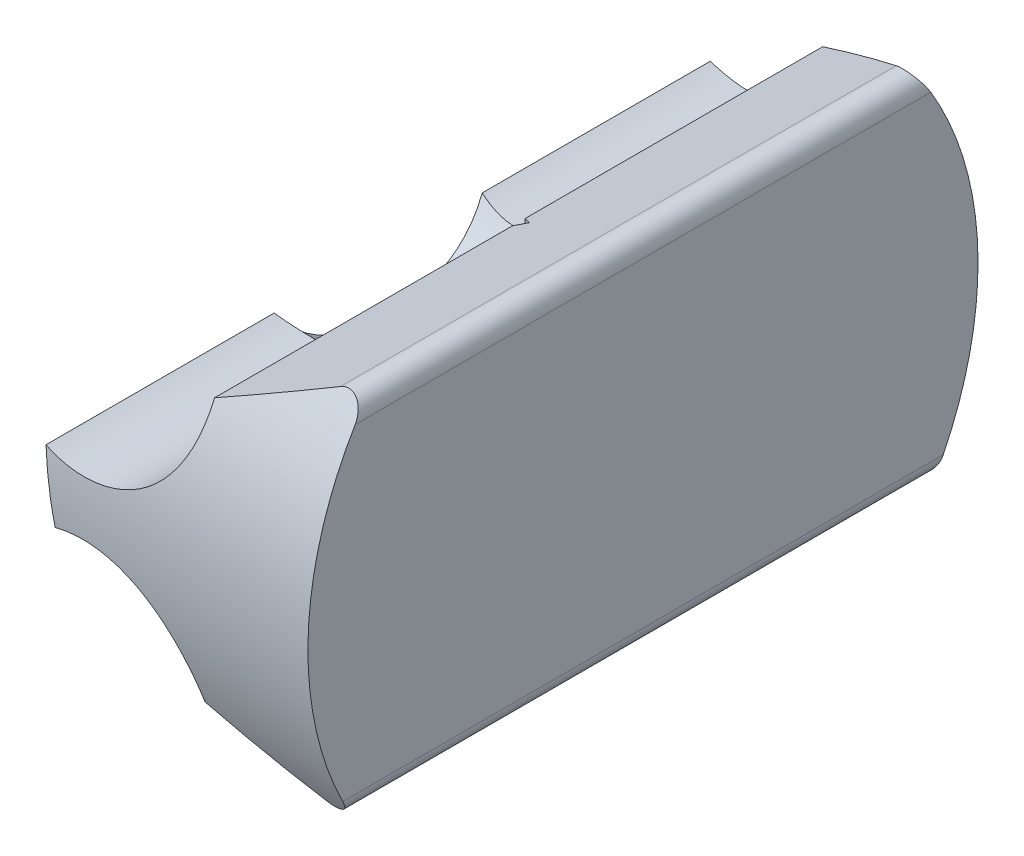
from build123d import *

# Parameters (mm, degrees)
BOSS_EXTRUDE1_DEPTH = 15.9004
SKETCH2_OUTSIDE_W   = 21.7
SKETCH2_OUTSIDE_H   = 14.138
CUT_EXTRUDE1_DEPTH  = 15.9004
CUT_EXTRUDE3_START  = -0.254
CUT_EXTRUDE3_DEPTH  = 19.9878159
SKETCH7_W           = 2.032
SKETCH7_H           = 0.508
CUT_EXTRUDE4_DEPTH  = 19.7338159
CUT_EXTRUDE7_DEPTH  = 13.3604


with BuildPart() as part:
    # Sketch1 → Boss-Extrude1 (new body)
    with BuildSketch(Plane.XY):
        with BuildLine():
            Line((0, 0.637920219), (0, 8.163179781))
            ThreePointArc((0, 8.163179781), (-0.188041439, 8.505934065), (-0.578152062, 8.531503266))
            Line((-0.578152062, 8.531503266), (-2.921, 7.439015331))
            ThreePointArc((-2.921, 7.439015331), (-3.952327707, 5.401951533), (-6.223, 5.16255))
            Line((-6.223, 5.16255), (-5.954277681, 3.63855))
            ThreePointArc((-5.954277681, 3.63855), (-3.875330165, 3.249565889), (-2.921, 1.362084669))
            Line((-2.921, 1.362084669), (-0.578152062, 0.269596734))
            ThreePointArc((-0.578152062, 0.269596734), (-0.188041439, 0.295165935), (0, 0.637920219))
        make_face()
    extrude(amount=BOSS_EXTRUDE1_DEPTH)

    # Sketch2 outside → Cut-Extrude1 (cut)
    with BuildSketch(Plane(origin=(0, 0, 0), x_dir=(0, 0, -1), z_dir=(1, 0, 0))):
        with Locations((-7.95, 4.401)):
            Rectangle(SKETCH2_OUTSIDE_W, SKETCH2_OUTSIDE_H)
        with BuildLine():
            Line((-2.742982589, -1.775379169), (-13.546540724, -1.408076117))
            ThreePointArc((-13.546540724, -1.408076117), (-15.780188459, 4.962311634), (-12.25865406, 10.721636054))
            Line((-12.25865406, 10.721636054), (-3.700201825, 10.759481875))
            ThreePointArc((-3.700201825, 10.759481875), (-0.099058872, 4.730502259), (-2.742982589, -1.775379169))
        make_face(mode=Mode.SUBTRACT)
    extrude(amount=-CUT_EXTRUDE1_DEPTH, mode=Mode.SUBTRACT)

    # Sketch4 → Cut-Extrude3 (cut, through all)
    with BuildSketch(Plane.ZY.offset(5.207).offset(CUT_EXTRUDE3_START)):
        with BuildLine():
            Line((8.9662, 4.14655), (6.9342, 4.14655))
            ThreePointArc((6.9342, 4.14655), (6.118014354, 4.51197249), (5.504466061, 5.16255))
            Line((5.504466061, 5.16255), (10.395933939, 5.16255))
            ThreePointArc((10.395933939, 5.16255), (9.782385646, 4.51197249), (8.9662, 4.14655))
        make_face()
    extrude(amount=CUT_EXTRUDE3_DEPTH, mode=Mode.SUBTRACT)

    # Sketch7 → Cut-Extrude4 (cut, through all)
    with BuildSketch(Plane.ZY.offset(5.207)):
        with Locations((7.9502, 3.89255)):
            Rectangle(SKETCH7_W, SKETCH7_H)
    extrude(amount=CUT_EXTRUDE4_DEPTH, mode=Mode.SUBTRACT)

    # Sketch14 → Cut-Extrude7 (cut)
    with BuildSketch(Plane(origin=(0, 6.169015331, 0), x_dir=(0, 0, -1), z_dir=(0, -1, 0))):
        Polygon((-8.83008181, -4.191), (-7.9502, -2.667), (-7.07031819, -4.191), align=None)
    extrude(amount=-CUT_EXTRUDE7_DEPTH, mode=Mode.SUBTRACT)


solid = part.part
